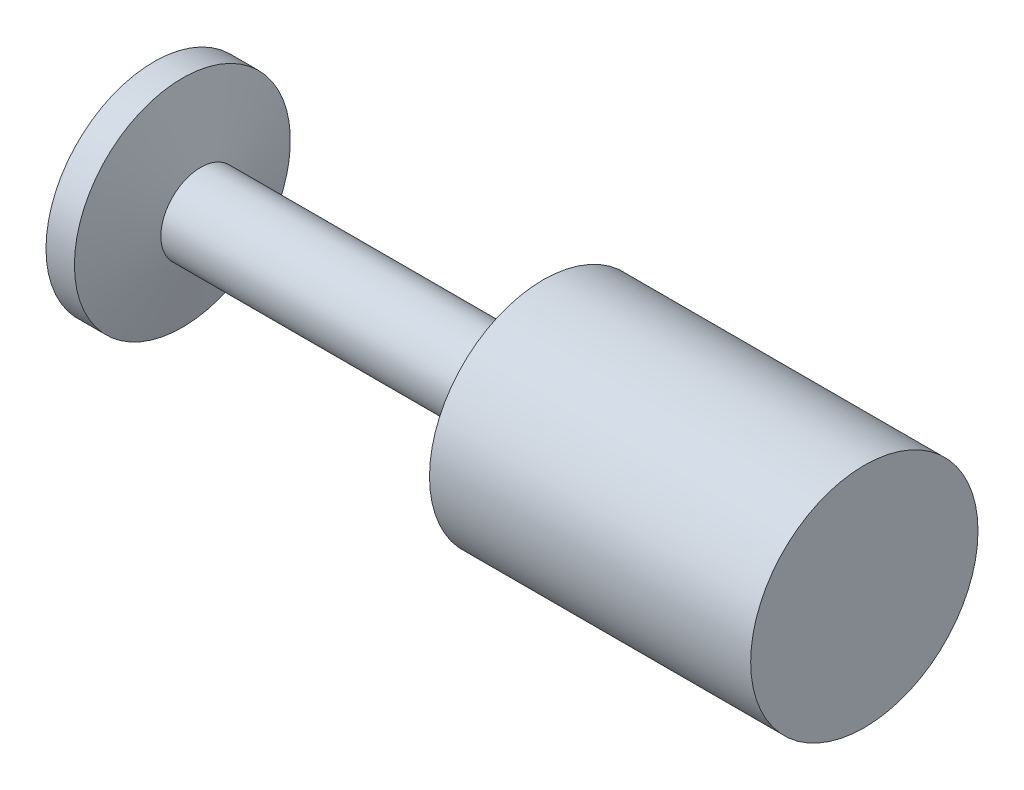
from build123d import *


with BuildPart() as part:
    # Esquisse1 → R_volution1 (revolve)
    with BuildSketch(Plane.XY, mode=Mode.PRIVATE) as r_volution1_sk:
        Polygon((0, 0), (0, 19), (5, 19), (8.215390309, 7), (65, 7), (68.483339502, 20), (125, 20), (125, 0), align=None)
    revolve(r_volution1_sk.sketch.rotate(Axis((-18.055301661, 0, 0), (1, 0, 0)), 90), axis=Axis((-18.055301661, 0, 0), (1, 0, 0)))


solid = part.part
